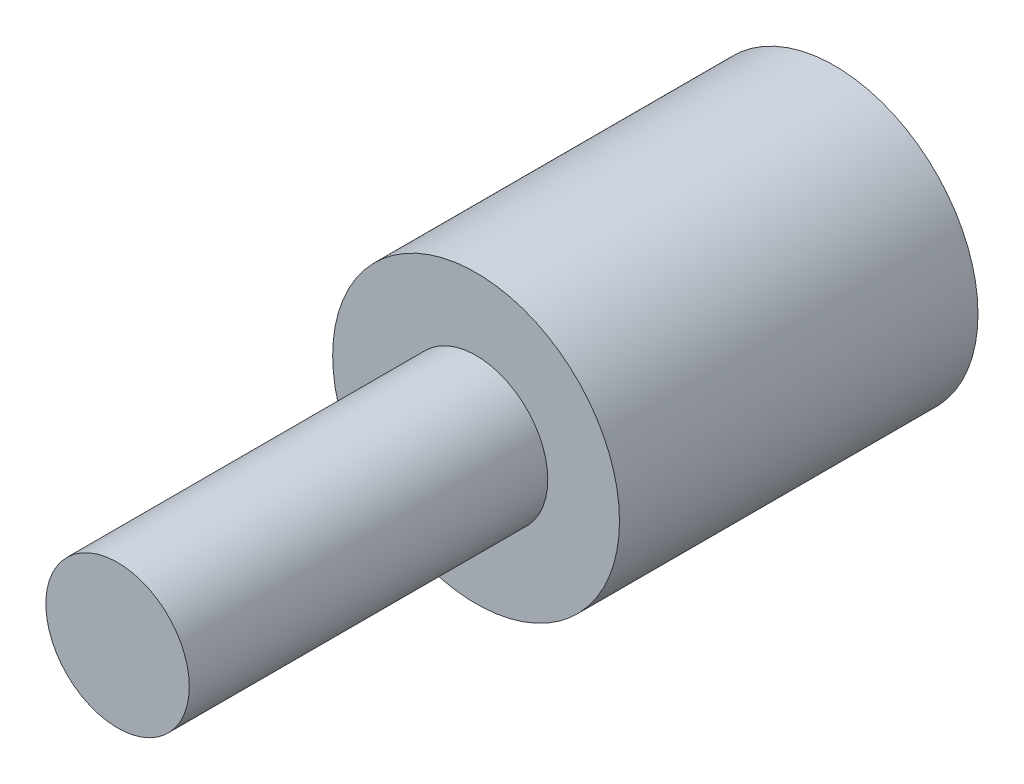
from build123d import *

# Parameters (mm, degrees)
SKETCH2_R          = 20
CUT_EXTRUDE1_DEPTH = 20


with BuildPart() as part:
    # Sketch1 → Revolve1 (revolve)
    with BuildSketch(Plane(origin=(0, 0, 0), x_dir=(0, 0, -1), z_dir=(1, 0, 0)), mode=Mode.PRIVATE) as revolve1_sk:
        Polygon((0, 0), (150, 0), (150, 30), (75, 30), (75, 15), (0, 15), align=None)
    revolve(revolve1_sk.sketch.rotate(Axis((0, 0, 0), (0, 0, -1)), 90), axis=Axis((0, 0, 0), (0, 0, -1)))

    # Sketch2 → Cut-Extrude1 (cut)
    with BuildSketch(Plane(origin=(0, 0, -150), x_dir=(-1, 0, 0), z_dir=(0, 0, -1))):
        Circle(SKETCH2_R)
    extrude(amount=-CUT_EXTRUDE1_DEPTH, mode=Mode.SUBTRACT)


solid = part.part
